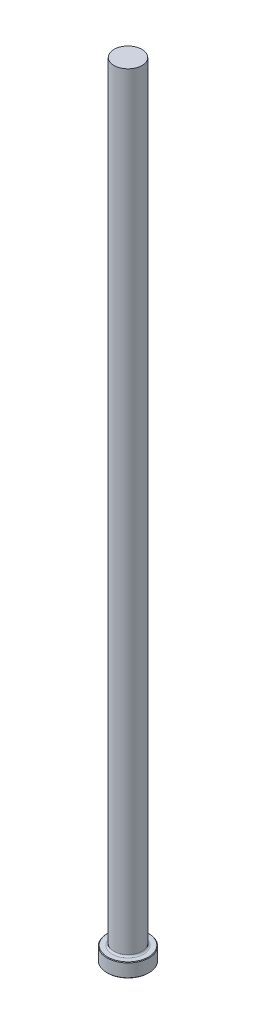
ISO-10303-21;
HEADER;
FILE_DESCRIPTION(('STEP AP214'),'2;1');
FILE_NAME('part.step','',(''),(''),'','','');
FILE_SCHEMA(('AUTOMOTIVE_DESIGN { 1 0 10303 214 1 1 1 1 }'));
ENDSEC;
DATA;
#1=APPLICATION_CONTEXT('core data for automotive mechanical design processes');
#2=APPLICATION_PROTOCOL_DEFINITION('international standard','automotive_design',2000,#1);
#3=PRODUCT_CONTEXT('',#1,'mechanical');
#4=PRODUCT('Part','Part','',(#3));
#5=PRODUCT_RELATED_PRODUCT_CATEGORY('part','',(#4));
#6=PRODUCT_DEFINITION_FORMATION('','',#4);
#7=PRODUCT_DEFINITION_CONTEXT('part definition',#1,'design');
#8=PRODUCT_DEFINITION('design','',#6,#7);
#9=PRODUCT_DEFINITION_SHAPE('','',#8);
#10=(LENGTH_UNIT() NAMED_UNIT(*) SI_UNIT(.MILLI.,.METRE.));
#11=(NAMED_UNIT(*) PLANE_ANGLE_UNIT() SI_UNIT($,.RADIAN.));
#12=(NAMED_UNIT(*) SI_UNIT($,.STERADIAN.) SOLID_ANGLE_UNIT());
#13=UNCERTAINTY_MEASURE_WITH_UNIT(LENGTH_MEASURE(1.E-05),#10,'distance_accuracy_value','');
#14=(GEOMETRIC_REPRESENTATION_CONTEXT(3) GLOBAL_UNCERTAINTY_ASSIGNED_CONTEXT((#13)) GLOBAL_UNIT_ASSIGNED_CONTEXT((#10,
#11,#12)) REPRESENTATION_CONTEXT('',''));
#15=CARTESIAN_POINT('',(0.,0.,0.));
#16=DIRECTION('',(0.,0.,1.));
#17=DIRECTION('',(1.,0.,0.));
#18=AXIS2_PLACEMENT_3D('',#15,#16,#17);
#19=CARTESIAN_POINT('',(0.,0.,0.));
#20=DIRECTION('',(0.,-1.,0.));
#21=DIRECTION('',(0.,0.,-1.));
#22=AXIS2_PLACEMENT_3D('',#19,#20,#21);
#23=PLANE('',#22);
#24=CARTESIAN_POINT('',(0.,0.,0.));
#25=DIRECTION('',(0.,-1.,0.));
#26=DIRECTION('',(0.,0.,-1.));
#27=AXIS2_PLACEMENT_3D('',#24,#25,#26);
#28=CIRCLE('',#27,9.27100000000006);
#29=CARTESIAN_POINT('',(0.,0.,-9.27100000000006));
#30=VERTEX_POINT('',#29);
#31=EDGE_CURVE('E46',#30,#30,#28,.T.);
#32=ORIENTED_EDGE('',*,*,#31,.T.);
#33=EDGE_LOOP('',(#32));
#34=FACE_BOUND('',#33,.T.);
#35=ADVANCED_FACE('F35',(#34),#23,.T.);
#36=CARTESIAN_POINT('',(0.,259.958771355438,0.));
#37=DIRECTION('',(0.,1.,0.));
#38=DIRECTION('',(0.,0.,1.));
#39=AXIS2_PLACEMENT_3D('',#36,#37,#38);
#40=CYLINDRICAL_SURFACE('',#39,9.52499999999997);
#41=CARTESIAN_POINT('',(0.,6.09600000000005,0.));
#42=DIRECTION('',(0.,1.,0.));
#43=DIRECTION('',(0.,0.,1.));
#44=AXIS2_PLACEMENT_3D('',#41,#42,#43);
#45=CIRCLE('',#44,9.52499999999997);
#46=CARTESIAN_POINT('',(0.,6.09600000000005,9.52499999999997));
#47=VERTEX_POINT('',#46);
#48=EDGE_CURVE('E50',#47,#47,#45,.F.);
#49=ORIENTED_EDGE('',*,*,#48,.T.);
#50=EDGE_LOOP('',(#49));
#51=FACE_BOUND('',#50,.T.);
#52=CARTESIAN_POINT('',(0.,0.253999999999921,0.));
#53=DIRECTION('',(0.,-1.,0.));
#54=DIRECTION('',(0.,0.,-1.));
#55=AXIS2_PLACEMENT_3D('',#52,#53,#54);
#56=CIRCLE('',#55,9.52499999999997);
#57=CARTESIAN_POINT('',(0.,0.253999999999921,-9.52499999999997));
#58=VERTEX_POINT('',#57);
#59=EDGE_CURVE('E55',#58,#58,#56,.F.);
#60=ORIENTED_EDGE('',*,*,#59,.T.);
#61=EDGE_LOOP('',(#60));
#62=FACE_BOUND('',#61,.T.);
#63=ADVANCED_FACE('F77',(#51,#62),#40,.T.);
#64=CARTESIAN_POINT('',(-9.52499999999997,6.35,0.));
#65=DIRECTION('',(0.,1.,0.));
#66=DIRECTION('',(0.,0.,1.));
#67=AXIS2_PLACEMENT_3D('',#64,#65,#66);
#68=PLANE('',#67);
#69=CARTESIAN_POINT('',(0.,6.35,0.));
#70=DIRECTION('',(0.,1.,0.));
#71=DIRECTION('',(0.,0.,1.));
#72=AXIS2_PLACEMENT_3D('',#69,#70,#71);
#73=CIRCLE('',#72,7.11199999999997);
#74=CARTESIAN_POINT('',(0.,6.35,7.11199999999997));
#75=VERTEX_POINT('',#74);
#76=EDGE_CURVE('E10',#75,#75,#73,.F.);
#77=ORIENTED_EDGE('',*,*,#76,.T.);
#78=EDGE_LOOP('',(#77));
#79=FACE_BOUND('',#78,.T.);
#80=CARTESIAN_POINT('',(0.,6.35,0.));
#81=DIRECTION('',(0.,1.,0.));
#82=DIRECTION('',(0.,0.,1.));
#83=AXIS2_PLACEMENT_3D('',#80,#81,#82);
#84=CIRCLE('',#83,9.27100000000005);
#85=CARTESIAN_POINT('',(0.,6.35,9.27100000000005));
#86=VERTEX_POINT('',#85);
#87=EDGE_CURVE('E58',#86,#86,#84,.T.);
#88=ORIENTED_EDGE('',*,*,#87,.T.);
#89=EDGE_LOOP('',(#88));
#90=FACE_BOUND('',#89,.T.);
#91=ADVANCED_FACE('F69',(#79,#90),#68,.T.);
#92=CARTESIAN_POINT('',(0.,259.958771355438,0.));
#93=DIRECTION('',(0.,1.,0.));
#94=DIRECTION('',(0.,0.,1.));
#95=AXIS2_PLACEMENT_3D('',#92,#93,#94);
#96=CYLINDRICAL_SURFACE('',#95,6.34999999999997);
#97=CARTESIAN_POINT('',(0.,7.11200000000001,0.));
#98=DIRECTION('',(0.,1.,0.));
#99=DIRECTION('',(0.,0.,1.));
#100=AXIS2_PLACEMENT_3D('',#97,#98,#99);
#101=CIRCLE('',#100,6.34999999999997);
#102=CARTESIAN_POINT('',(0.,7.11200000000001,6.34999999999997));
#103=VERTEX_POINT('',#102);
#104=EDGE_CURVE('E42',#103,#103,#101,.T.);
#105=ORIENTED_EDGE('',*,*,#104,.T.);
#106=EDGE_LOOP('',(#105));
#107=FACE_BOUND('',#106,.T.);
#108=CARTESIAN_POINT('',(0.,355.6,0.));
#109=DIRECTION('',(0.,1.,0.));
#110=DIRECTION('',(0.,0.,1.));
#111=AXIS2_PLACEMENT_3D('',#108,#109,#110);
#112=CIRCLE('',#111,6.34999999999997);
#113=CARTESIAN_POINT('',(0.,355.6,6.34999999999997));
#114=VERTEX_POINT('',#113);
#115=EDGE_CURVE('E61',#114,#114,#112,.T.);
#116=ORIENTED_EDGE('',*,*,#115,.F.);
#117=EDGE_LOOP('',(#116));
#118=FACE_BOUND('',#117,.T.);
#119=ADVANCED_FACE('F67',(#107,#118),#96,.T.);
#120=CARTESIAN_POINT('',(-6.34999999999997,355.6,0.));
#121=DIRECTION('',(0.,1.,0.));
#122=DIRECTION('',(0.,0.,1.));
#123=AXIS2_PLACEMENT_3D('',#120,#121,#122);
#124=PLANE('',#123);
#125=ORIENTED_EDGE('',*,*,#115,.T.);
#126=EDGE_LOOP('',(#125));
#127=FACE_BOUND('',#126,.T.);
#128=ADVANCED_FACE('F65',(#127),#124,.T.);
#129=CARTESIAN_POINT('',(0.,6.35000000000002,0.));
#130=DIRECTION('',(0.,-1.,0.));
#131=DIRECTION('',(0.,0.,-1.));
#132=AXIS2_PLACEMENT_3D('',#129,#130,#131);
#133=CONICAL_SURFACE('',#132,9.27100000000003,0.785398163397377);
#134=ORIENTED_EDGE('',*,*,#48,.F.);
#135=EDGE_LOOP('',(#134));
#136=FACE_BOUND('',#135,.T.);
#137=ORIENTED_EDGE('',*,*,#87,.F.);
#138=EDGE_LOOP('',(#137));
#139=FACE_BOUND('',#138,.T.);
#140=ADVANCED_FACE('F75',(#136,#139),#133,.T.);
#141=CARTESIAN_POINT('',(0.,0.253999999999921,0.));
#142=DIRECTION('',(0.,1.,0.));
#143=DIRECTION('',(0.,0.,1.));
#144=AXIS2_PLACEMENT_3D('',#141,#142,#143);
#145=CONICAL_SURFACE('',#144,9.52499999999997,0.785398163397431);
#146=ORIENTED_EDGE('',*,*,#31,.F.);
#147=EDGE_LOOP('',(#146));
#148=FACE_BOUND('',#147,.T.);
#149=ORIENTED_EDGE('',*,*,#59,.F.);
#150=EDGE_LOOP('',(#149));
#151=FACE_BOUND('',#150,.T.);
#152=ADVANCED_FACE('F89',(#148,#151),#145,.T.);
#153=CARTESIAN_POINT('',(0.,7.11200000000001,0.));
#154=DIRECTION('',(0.,1.,0.));
#155=DIRECTION('',(0.,0.,1.));
#156=AXIS2_PLACEMENT_3D('',#153,#154,#155);
#157=TOROIDAL_SURFACE('',#156,7.11199999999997,0.762);
#158=ORIENTED_EDGE('',*,*,#76,.F.);
#159=EDGE_LOOP('',(#158));
#160=FACE_BOUND('',#159,.T.);
#161=ORIENTED_EDGE('',*,*,#104,.F.);
#162=EDGE_LOOP('',(#161));
#163=FACE_BOUND('',#162,.T.);
#164=ADVANCED_FACE('F37',(#160,#163),#157,.F.);
#165=CLOSED_SHELL('',(#35,#63,#91,#119,#128,#140,#152,#164));
#166=MANIFOLD_SOLID_BREP('B2',#165);
#167=ADVANCED_BREP_SHAPE_REPRESENTATION('',(#18,#166),#14);
#168=SHAPE_DEFINITION_REPRESENTATION(#9,#167);
ENDSEC;
END-ISO-10303-21;
